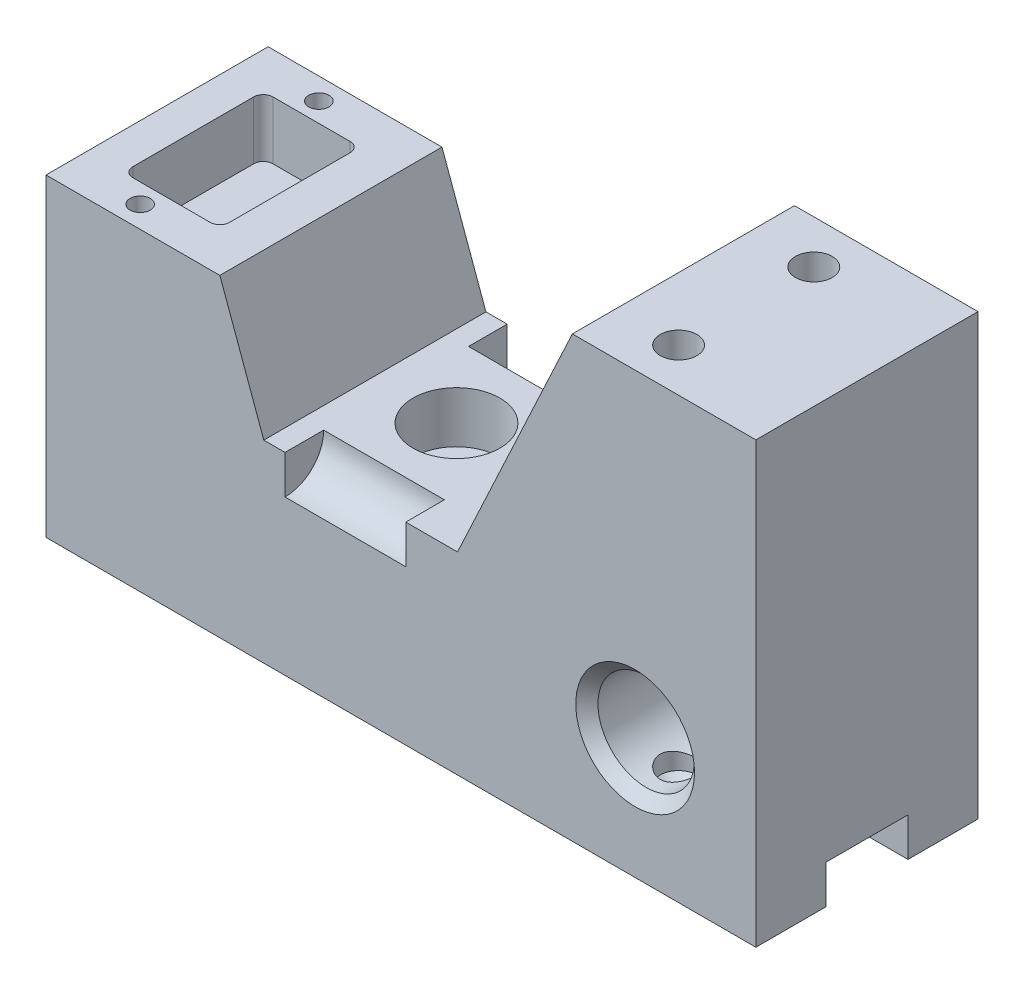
from build123d import *

# Parameters (mm, degrees)
SKETCH1_R                                            = 10
BOSS_EXTRUDE1_DEPTH                                  = 23
CHAMFER1_SIZE                                        = 2.3
SKETCH2_W                                            = 20
SKETCH2_H                                            = 29
CUT_EXTRUDE1_DEPTH                                   = 12
FILLET1_R                                            = 2
F_7_6_7_6_DIAMETER_HOLE1_D                           = 7.6
F_7_6_7_6_DIAMETER_HOLE1_DEPTH                       = 79
F_7_6_7_6_DIAMETER_HOLE1_TIP                         = 2.283270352
SKETCH6_W                                            = 17
SKETCH6_H                                            = 8
CUT_EXTRUDE2_DEPTH                                   = 175.41043552
CBORE_FOR_M10_HEX_SOCKET_HEAD_CAP_SCREW1_D           = 11
CBORE_FOR_M10_HEX_SOCKET_HEAD_CAP_SCREW1_DEPTH       = 83
CBORE_FOR_M10_HEX_SOCKET_HEAD_CAP_SCREW1_CBORE_D     = 18
CBORE_FOR_M10_HEX_SOCKET_HEAD_CAP_SCREW1_CBORE_DEPTH = 10.6
CBORE_FOR_M10_HEX_SOCKET_HEAD_CAP_SCREW1_TIP         = 3.304733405
M5_TAPPED_HOLE1_D                                    = 4.2
M5_TAPPED_HOLE1_DEPTH                                = 12.4
M5_TAPPED_HOLE1_TIP                                  = 1.2618073
SKETCH13_R                                           = 8
CUT_EXTRUDE3_DEPTH                                   = 12.5


with BuildPart() as part:
    # Sketch1 → Boss-Extrude1 (new, symmetric)
    with BuildSketch(Plane.XY):
        Polygon((0, 0), (0, 65), (36, 65), (45.099255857, 40), (85.218309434, 40), (109, 91), (147, 91), (147, 0), align=None)
        with Locations((122, 25)):
            Circle(SKETCH1_R, mode=Mode.SUBTRACT)
    extrude(amount=BOSS_EXTRUDE1_DEPTH, both=True)

    # Chamfer1
    chamfer1_edges = [part.edges().sort_by_distance(p)[0] for p in [
        (112, 25, -23),
        (112, 25, 23),
    ]]
    chamfer(chamfer1_edges, length=CHAMFER1_SIZE)

    # Sketch2 → Cut-Extrude1 (cut)
    with BuildSketch(Plane(origin=(0, 65, 0), x_dir=(1, 0, 0), z_dir=(0, 1, 0))):
        with Locations((17.5, 0)):
            Rectangle(SKETCH2_W, SKETCH2_H)
    extrude(amount=-CUT_EXTRUDE1_DEPTH, mode=Mode.SUBTRACT)

    # Fillet1
    fillet1_edges = [part.edges().sort_by_distance(p)[0] for p in [
        (27.5, 59, -14.5),
        (27.5, 59, 14.5),
        (7.5, 59, 14.5),
        (7.5, 59, -14.5),
    ]]
    fillet(fillet1_edges, radius=FILLET1_R)

    # 7.6 _7.6_ Diameter Hole1
    with Locations(Plane(origin=(0, 91, 0), x_dir=(1, 0, 0), z_dir=(0, 1, 0))):
        with Locations((122, -14), (122, 14)):
            Hole(F_7_6_7_6_DIAMETER_HOLE1_D / 2, depth=F_7_6_7_6_DIAMETER_HOLE1_DEPTH)
            with Locations((0, 0, -(F_7_6_7_6_DIAMETER_HOLE1_DEPTH + F_7_6_7_6_DIAMETER_HOLE1_TIP / 2))):  # 118° drill point
                Cone(0, F_7_6_7_6_DIAMETER_HOLE1_D / 2, F_7_6_7_6_DIAMETER_HOLE1_TIP, mode=Mode.SUBTRACT)

    # Sketch6 → Cut-Extrude2 (cut, through all)
    with BuildSketch(Plane(origin=(147, 0, 0), x_dir=(0, 0, -1), z_dir=(1, 0, 0))):
        with Locations((0, 4)):
            Rectangle(SKETCH6_W, SKETCH6_H)
    extrude(amount=-CUT_EXTRUDE2_DEPTH, mode=Mode.SUBTRACT)

    # CBORE for M10 Hex Socket Head Cap Screw1
    with Locations(Plane(origin=(0, 40, 0), x_dir=(1, 0, 0), z_dir=(0, 1, 0))):
        with Locations((62, 0)):
            CounterBoreHole(CBORE_FOR_M10_HEX_SOCKET_HEAD_CAP_SCREW1_D / 2, CBORE_FOR_M10_HEX_SOCKET_HEAD_CAP_SCREW1_CBORE_D / 2, CBORE_FOR_M10_HEX_SOCKET_HEAD_CAP_SCREW1_CBORE_DEPTH, depth=CBORE_FOR_M10_HEX_SOCKET_HEAD_CAP_SCREW1_DEPTH)
            with Locations((0, 0, -(CBORE_FOR_M10_HEX_SOCKET_HEAD_CAP_SCREW1_DEPTH + CBORE_FOR_M10_HEX_SOCKET_HEAD_CAP_SCREW1_TIP / 2))):  # 118° drill point
                Cone(0, CBORE_FOR_M10_HEX_SOCKET_HEAD_CAP_SCREW1_D / 2, CBORE_FOR_M10_HEX_SOCKET_HEAD_CAP_SCREW1_TIP, mode=Mode.SUBTRACT)

    # M5 Tapped Hole1
    with Locations(Plane(origin=(0, 65, 0), x_dir=(1, 0, 0), z_dir=(0, 1, 0))):
        with Locations((15, -18.5), (15, 18.5)):
            Hole(M5_TAPPED_HOLE1_D / 2, depth=M5_TAPPED_HOLE1_DEPTH)
            with Locations((0, 0, -(M5_TAPPED_HOLE1_DEPTH + M5_TAPPED_HOLE1_TIP / 2))):  # 118° drill point
                Cone(0, M5_TAPPED_HOLE1_D / 2, M5_TAPPED_HOLE1_TIP, mode=Mode.SUBTRACT)

    # Sketch13 → Cut-Extrude3 (cut, symmetric)
    with BuildSketch(Plane(origin=(62, 0, 0), x_dir=(0, 0, -1), z_dir=(1, 0, 0))):
        with Locations((-23, 40)):
            Circle(SKETCH13_R)
    cut_extrude3 = extrude(amount=CUT_EXTRUDE3_DEPTH, both=True, mode=Mode.SUBTRACT)

    # Mirror1: Cut-Extrude3 across plane
    add(cut_extrude3.mirror(Plane.XY), mode=Mode.SUBTRACT)


solid = part.part
